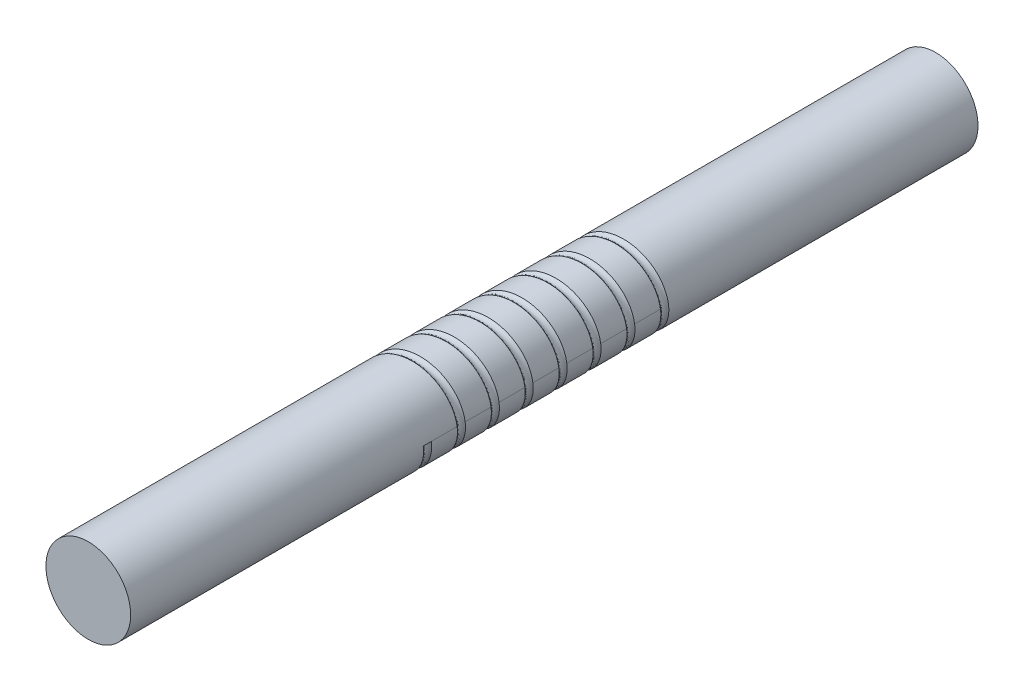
from build123d import *

# Parameters (mm, degrees)
SKETCH1_R              = 25
BOSS_EXTRUDE1_DEPTH    = 500
CUT_SWEEP1_PITCH       = 20
CUT_SWEEP1_HEIGHT      = 150
CUT_SWEEP1_RADIUS      = 27.116666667
CUT_SWEEP1_START_ANGLE = -180
SKETCH3_R              = 3.175


with BuildPart() as part:
    # Sketch1 → Boss-Extrude1 (new body)
    with BuildSketch(Plane.XY):
        Circle(SKETCH1_R)
    extrude(amount=BOSS_EXTRUDE1_DEPTH)

    # Cut-Sweep1: sweep along a helix
    with BuildLine() as cut_sweep1_path:
        add(Helix(CUT_SWEEP1_PITCH, CUT_SWEEP1_HEIGHT, CUT_SWEEP1_RADIUS, center=(0, 0, 175), direction=(0, 0, 1), mode=Mode.PRIVATE).rotate(Axis((0, 0, 175), (0, 0, 1)), CUT_SWEEP1_START_ANGLE))
    # Sketch3 → Cut-Sweep1 (sweep, cut)
    with BuildSketch(Plane(origin=(0, 0, 0), x_dir=(1, 0, 0), z_dir=(0, 1, 0))):
        with Locations((-27.116666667, -175)):
            Circle(SKETCH3_R)
    sweep(path=cut_sweep1_path.line, is_frenet=True, mode=Mode.SUBTRACT)


solid = part.part
